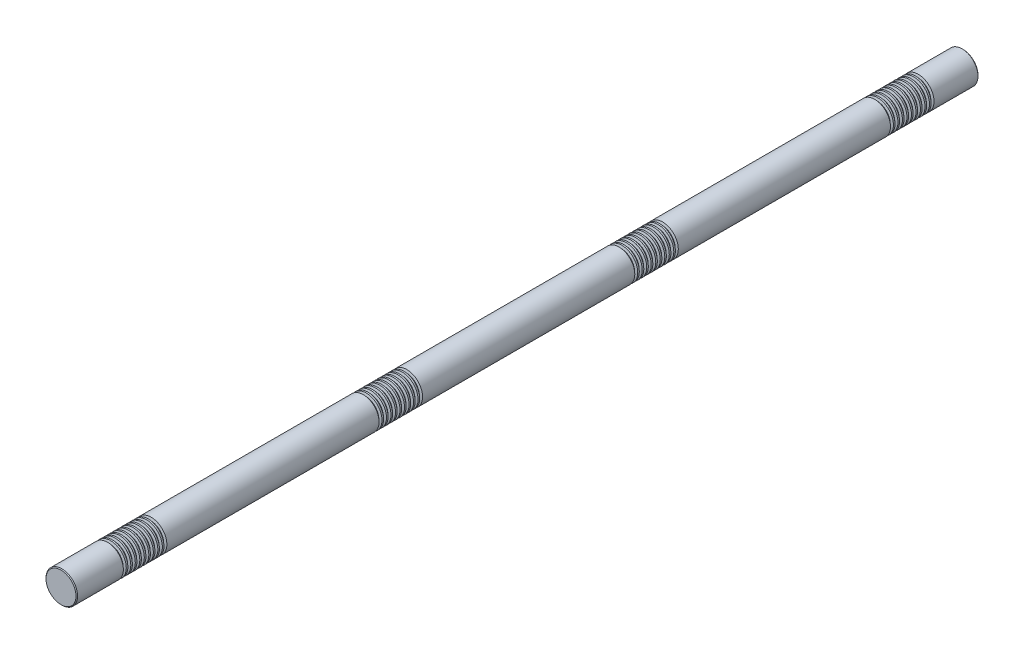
from build123d import *

# Parameters (mm, degrees)
SKETCH1_R           = 35
BOSS_EXTRUDE1_DEPTH = 1000
CHAMFER1_SIZE       = 1.75
LPATTERN1_COUNT     = 10
LPATTERN1_PITCH     = 10
LPATTERN2_COUNT     = 4
LPATTERN2_PITCH     = 567


with BuildPart() as part:
    # Sketch1 → Boss-Extrude1 (new, symmetric)
    with BuildSketch(Plane.XY):
        Circle(SKETCH1_R)
    extrude(amount=BOSS_EXTRUDE1_DEPTH, both=True)

    # Chamfer1
    chamfer1_edges = [part.edges().sort_by_distance(p)[0] for p in [
        (-35, 0, -1000),
        (-35, 0, 1000),
    ]]
    chamfer(chamfer1_edges, length=CHAMFER1_SIZE)

    # Sketch2 → Cut-Revolve1 (revolve, cut)
    with BuildSketch(Plane(origin=(0, 0, 0), x_dir=(0, 0, -1), z_dir=(1, 0, 0)), mode=Mode.PRIVATE) as cut_revolve1_sk:
        Polygon((900.736860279, 35), (894.263139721, 35), (895.736860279, 29.5), (899.263139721, 29.5), align=None)
    cut_revolve1 = revolve(cut_revolve1_sk.sketch.rotate(Axis((0, 0, 1000), (0, 0, -1)), 90), axis=Axis((0, 0, 1000), (0, 0, -1)), mode=Mode.SUBTRACT)

    # LPattern1: Cut-Revolve1 ×10
    with Locations(*[(0, 0, i * LPATTERN1_PITCH) for i in range(1, LPATTERN1_COUNT)]):
        add(cut_revolve1, mode=Mode.SUBTRACT)

    # LPattern2: Cut-Revolve1 ×4
    with Locations(*[(0, 0, i * LPATTERN2_PITCH) for i in range(1, LPATTERN2_COUNT)]):
        add(cut_revolve1, mode=Mode.SUBTRACT)

    # LPattern2 copy 1 sketch → LPattern2 copy 1 (revolve, cut)
    with BuildSketch(Plane(origin=(0, 0, 577), x_dir=(0, 0, -1), z_dir=(1, 0, 0))):
        Polygon((900.736860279, 35), (894.263139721, 35), (895.736860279, 29.5), (899.263139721, 29.5), align=None)
    revolve(axis=Axis((0, 0, 1577), (0, 0, -1)), mode=Mode.SUBTRACT)

    # LPattern2 copy 2 sketch → LPattern2 copy 2 (revolve, cut)
    with BuildSketch(Plane(origin=(0, 0, 1144), x_dir=(0, 0, -1), z_dir=(1, 0, 0))):
        Polygon((900.736860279, 35), (894.263139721, 35), (895.736860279, 29.5), (899.263139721, 29.5), align=None)
    revolve(axis=Axis((0, 0, 2144), (0, 0, -1)), mode=Mode.SUBTRACT)

    # LPattern2 copy 3 sketch → LPattern2 copy 3 (revolve, cut)
    with BuildSketch(Plane(origin=(0, 0, 1711), x_dir=(0, 0, -1), z_dir=(1, 0, 0))):
        Polygon((900.736860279, 35), (894.263139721, 35), (895.736860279, 29.5), (899.263139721, 29.5), align=None)
    revolve(axis=Axis((0, 0, 2711), (0, 0, -1)), mode=Mode.SUBTRACT)

    # LPattern2 copy 4 sketch → LPattern2 copy 4 (revolve, cut)
    with BuildSketch(Plane(origin=(0, 0, 587), x_dir=(0, 0, -1), z_dir=(1, 0, 0))):
        Polygon((900.736860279, 35), (894.263139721, 35), (895.736860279, 29.5), (899.263139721, 29.5), align=None)
    revolve(axis=Axis((0, 0, 1587), (0, 0, -1)), mode=Mode.SUBTRACT)

    # LPattern2 copy 5 sketch → LPattern2 copy 5 (revolve, cut)
    with BuildSketch(Plane(origin=(0, 0, 1154), x_dir=(0, 0, -1), z_dir=(1, 0, 0))):
        Polygon((900.736860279, 35), (894.263139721, 35), (895.736860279, 29.5), (899.263139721, 29.5), align=None)
    revolve(axis=Axis((0, 0, 2154), (0, 0, -1)), mode=Mode.SUBTRACT)

    # LPattern2 copy 6 sketch → LPattern2 copy 6 (revolve, cut)
    with BuildSketch(Plane(origin=(0, 0, 1721), x_dir=(0, 0, -1), z_dir=(1, 0, 0))):
        Polygon((900.736860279, 35), (894.263139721, 35), (895.736860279, 29.5), (899.263139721, 29.5), align=None)
    revolve(axis=Axis((0, 0, 2721), (0, 0, -1)), mode=Mode.SUBTRACT)

    # LPattern2 copy 7 sketch → LPattern2 copy 7 (revolve, cut)
    with BuildSketch(Plane(origin=(0, 0, 597), x_dir=(0, 0, -1), z_dir=(1, 0, 0))):
        Polygon((900.736860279, 35), (894.263139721, 35), (895.736860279, 29.5), (899.263139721, 29.5), align=None)
    revolve(axis=Axis((0, 0, 1597), (0, 0, -1)), mode=Mode.SUBTRACT)

    # LPattern2 copy 8 sketch → LPattern2 copy 8 (revolve, cut)
    with BuildSketch(Plane(origin=(0, 0, 1164), x_dir=(0, 0, -1), z_dir=(1, 0, 0))):
        Polygon((900.736860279, 35), (894.263139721, 35), (895.736860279, 29.5), (899.263139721, 29.5), align=None)
    revolve(axis=Axis((0, 0, 2164), (0, 0, -1)), mode=Mode.SUBTRACT)

    # LPattern2 copy 9 sketch → LPattern2 copy 9 (revolve, cut)
    with BuildSketch(Plane(origin=(0, 0, 1731), x_dir=(0, 0, -1), z_dir=(1, 0, 0))):
        Polygon((900.736860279, 35), (894.263139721, 35), (895.736860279, 29.5), (899.263139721, 29.5), align=None)
    revolve(axis=Axis((0, 0, 2731), (0, 0, -1)), mode=Mode.SUBTRACT)

    # LPattern2 copy 10 sketch → LPattern2 copy 10 (revolve, cut)
    with BuildSketch(Plane(origin=(0, 0, 607), x_dir=(0, 0, -1), z_dir=(1, 0, 0))):
        Polygon((900.736860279, 35), (894.263139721, 35), (895.736860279, 29.5), (899.263139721, 29.5), align=None)
    revolve(axis=Axis((0, 0, 1607), (0, 0, -1)), mode=Mode.SUBTRACT)

    # LPattern2 copy 11 sketch → LPattern2 copy 11 (revolve, cut)
    with BuildSketch(Plane(origin=(0, 0, 1174), x_dir=(0, 0, -1), z_dir=(1, 0, 0))):
        Polygon((900.736860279, 35), (894.263139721, 35), (895.736860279, 29.5), (899.263139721, 29.5), align=None)
    revolve(axis=Axis((0, 0, 2174), (0, 0, -1)), mode=Mode.SUBTRACT)

    # LPattern2 copy 12 sketch → LPattern2 copy 12 (revolve, cut)
    with BuildSketch(Plane(origin=(0, 0, 1741), x_dir=(0, 0, -1), z_dir=(1, 0, 0))):
        Polygon((900.736860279, 35), (894.263139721, 35), (895.736860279, 29.5), (899.263139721, 29.5), align=None)
    revolve(axis=Axis((0, 0, 2741), (0, 0, -1)), mode=Mode.SUBTRACT)

    # LPattern2 copy 13 sketch → LPattern2 copy 13 (revolve, cut)
    with BuildSketch(Plane(origin=(0, 0, 617), x_dir=(0, 0, -1), z_dir=(1, 0, 0))):
        Polygon((900.736860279, 35), (894.263139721, 35), (895.736860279, 29.5), (899.263139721, 29.5), align=None)
    revolve(axis=Axis((0, 0, 1617), (0, 0, -1)), mode=Mode.SUBTRACT)

    # LPattern2 copy 14 sketch → LPattern2 copy 14 (revolve, cut)
    with BuildSketch(Plane(origin=(0, 0, 1184), x_dir=(0, 0, -1), z_dir=(1, 0, 0))):
        Polygon((900.736860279, 35), (894.263139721, 35), (895.736860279, 29.5), (899.263139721, 29.5), align=None)
    revolve(axis=Axis((0, 0, 2184), (0, 0, -1)), mode=Mode.SUBTRACT)

    # LPattern2 copy 15 sketch → LPattern2 copy 15 (revolve, cut)
    with BuildSketch(Plane(origin=(0, 0, 1751), x_dir=(0, 0, -1), z_dir=(1, 0, 0))):
        Polygon((900.736860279, 35), (894.263139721, 35), (895.736860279, 29.5), (899.263139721, 29.5), align=None)
    revolve(axis=Axis((0, 0, 2751), (0, 0, -1)), mode=Mode.SUBTRACT)

    # LPattern2 copy 16 sketch → LPattern2 copy 16 (revolve, cut)
    with BuildSketch(Plane(origin=(0, 0, 627), x_dir=(0, 0, -1), z_dir=(1, 0, 0))):
        Polygon((900.736860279, 35), (894.263139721, 35), (895.736860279, 29.5), (899.263139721, 29.5), align=None)
    revolve(axis=Axis((0, 0, 1627), (0, 0, -1)), mode=Mode.SUBTRACT)

    # LPattern2 copy 17 sketch → LPattern2 copy 17 (revolve, cut)
    with BuildSketch(Plane(origin=(0, 0, 1194), x_dir=(0, 0, -1), z_dir=(1, 0, 0))):
        Polygon((900.736860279, 35), (894.263139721, 35), (895.736860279, 29.5), (899.263139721, 29.5), align=None)
    revolve(axis=Axis((0, 0, 2194), (0, 0, -1)), mode=Mode.SUBTRACT)

    # LPattern2 copy 18 sketch → LPattern2 copy 18 (revolve, cut)
    with BuildSketch(Plane(origin=(0, 0, 1761), x_dir=(0, 0, -1), z_dir=(1, 0, 0))):
        Polygon((900.736860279, 35), (894.263139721, 35), (895.736860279, 29.5), (899.263139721, 29.5), align=None)
    revolve(axis=Axis((0, 0, 2761), (0, 0, -1)), mode=Mode.SUBTRACT)

    # LPattern2 copy 19 sketch → LPattern2 copy 19 (revolve, cut)
    with BuildSketch(Plane(origin=(0, 0, 637), x_dir=(0, 0, -1), z_dir=(1, 0, 0))):
        Polygon((900.736860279, 35), (894.263139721, 35), (895.736860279, 29.5), (899.263139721, 29.5), align=None)
    revolve(axis=Axis((0, 0, 1637), (0, 0, -1)), mode=Mode.SUBTRACT)

    # LPattern2 copy 20 sketch → LPattern2 copy 20 (revolve, cut)
    with BuildSketch(Plane(origin=(0, 0, 1204), x_dir=(0, 0, -1), z_dir=(1, 0, 0))):
        Polygon((900.736860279, 35), (894.263139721, 35), (895.736860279, 29.5), (899.263139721, 29.5), align=None)
    revolve(axis=Axis((0, 0, 2204), (0, 0, -1)), mode=Mode.SUBTRACT)

    # LPattern2 copy 21 sketch → LPattern2 copy 21 (revolve, cut)
    with BuildSketch(Plane(origin=(0, 0, 1771), x_dir=(0, 0, -1), z_dir=(1, 0, 0))):
        Polygon((900.736860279, 35), (894.263139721, 35), (895.736860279, 29.5), (899.263139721, 29.5), align=None)
    revolve(axis=Axis((0, 0, 2771), (0, 0, -1)), mode=Mode.SUBTRACT)

    # LPattern2 copy 22 sketch → LPattern2 copy 22 (revolve, cut)
    with BuildSketch(Plane(origin=(0, 0, 647), x_dir=(0, 0, -1), z_dir=(1, 0, 0))):
        Polygon((900.736860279, 35), (894.263139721, 35), (895.736860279, 29.5), (899.263139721, 29.5), align=None)
    revolve(axis=Axis((0, 0, 1647), (0, 0, -1)), mode=Mode.SUBTRACT)

    # LPattern2 copy 23 sketch → LPattern2 copy 23 (revolve, cut)
    with BuildSketch(Plane(origin=(0, 0, 1214), x_dir=(0, 0, -1), z_dir=(1, 0, 0))):
        Polygon((900.736860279, 35), (894.263139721, 35), (895.736860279, 29.5), (899.263139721, 29.5), align=None)
    revolve(axis=Axis((0, 0, 2214), (0, 0, -1)), mode=Mode.SUBTRACT)

    # LPattern2 copy 24 sketch → LPattern2 copy 24 (revolve, cut)
    with BuildSketch(Plane(origin=(0, 0, 1781), x_dir=(0, 0, -1), z_dir=(1, 0, 0))):
        Polygon((900.736860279, 35), (894.263139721, 35), (895.736860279, 29.5), (899.263139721, 29.5), align=None)
    revolve(axis=Axis((0, 0, 2781), (0, 0, -1)), mode=Mode.SUBTRACT)

    # LPattern2 copy 25 sketch → LPattern2 copy 25 (revolve, cut)
    with BuildSketch(Plane(origin=(0, 0, 657), x_dir=(0, 0, -1), z_dir=(1, 0, 0))):
        Polygon((900.736860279, 35), (894.263139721, 35), (895.736860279, 29.5), (899.263139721, 29.5), align=None)
    revolve(axis=Axis((0, 0, 1657), (0, 0, -1)), mode=Mode.SUBTRACT)

    # LPattern2 copy 26 sketch → LPattern2 copy 26 (revolve, cut)
    with BuildSketch(Plane(origin=(0, 0, 1224), x_dir=(0, 0, -1), z_dir=(1, 0, 0))):
        Polygon((900.736860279, 35), (894.263139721, 35), (895.736860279, 29.5), (899.263139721, 29.5), align=None)
    revolve(axis=Axis((0, 0, 2224), (0, 0, -1)), mode=Mode.SUBTRACT)

    # LPattern2 copy 27 sketch → LPattern2 copy 27 (revolve, cut)
    with BuildSketch(Plane(origin=(0, 0, 1791), x_dir=(0, 0, -1), z_dir=(1, 0, 0))):
        Polygon((900.736860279, 35), (894.263139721, 35), (895.736860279, 29.5), (899.263139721, 29.5), align=None)
    revolve(axis=Axis((0, 0, 2791), (0, 0, -1)), mode=Mode.SUBTRACT)


solid = part.part
